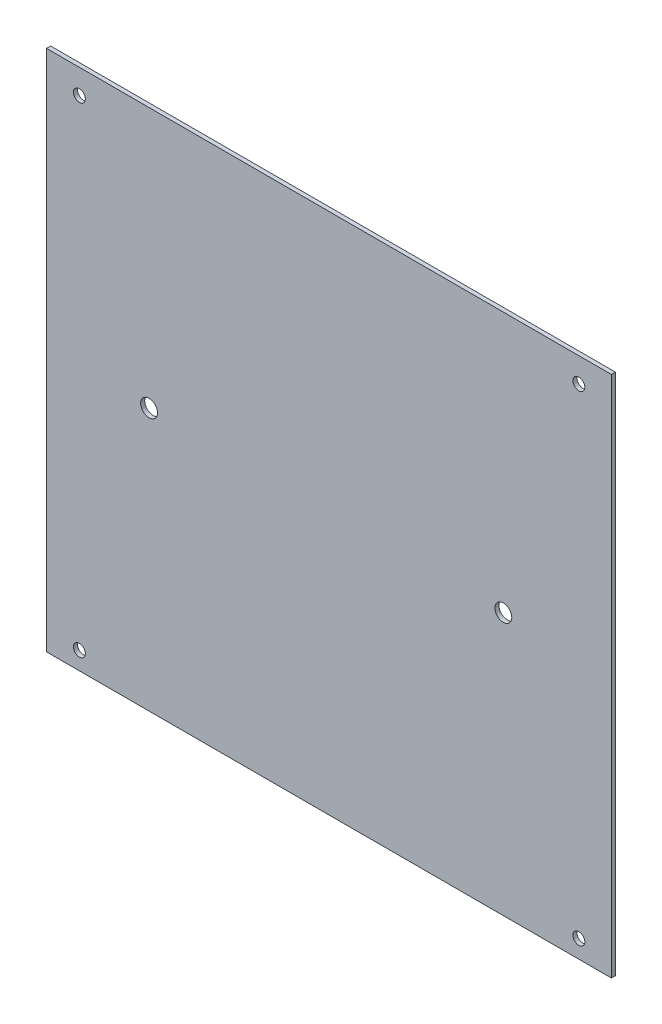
from build123d import *

# Parameters (mm, degrees)
SKETCH2_W                                      = 97.25
SKETCH2_H                                      = 90
BOSS_EXTRUDE1_DEPTH                            = 2
CSK_FOR_M2_5_FLAT_HEAD_MACHINE_SCREW3_AT_COUNT = 2
CSK_FOR_M2_5_FLAT_HEAD_MACHINE_SCREW3_AT_PITCH = 61
M2_5X0_45_TAPPED_HOLE1_D                       = 2.05
M2_5X0_45_TAPPED_HOLE1_DEPTH                   = 6.35
M2_5X0_45_TAPPED_HOLE1_TIP                     = 0.615882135
SKETCH29_W                                     = 97.25
SKETCH29_H                                     = 90
CUT_EXTRUDE1_DEPTH                             = 1.3


with BuildPart() as part:
    # Sketch2 → Boss-Extrude1 (new body)
    with BuildSketch(Plane.XY):
        with Locations((48.625, 45)):
            Rectangle(SKETCH2_W, SKETCH2_H)
    extrude(amount=BOSS_EXTRUDE1_DEPTH)

    # Sketch13 → CSK for M2.5 Flat Head Machine Screw3 (revolve, cut)
    with BuildSketch(Plane(origin=(78.65, 45.18, 2), x_dir=(0, -1, 0), z_dir=(1, 0, 0))):
        Polygon((0, 0), (0, 2), (1.45, 2), (1.45, 1.3), (2.75, 0), align=None)
    csk_for_m2_5_flat_head_machine_screw3 = revolve(axis=Axis((78.65, 45.18, 8.35), (0, 0, -1)), mode=Mode.SUBTRACT)

    # CSK for M2.5 Flat Head Machine Screw3 at: CSK for M2.5 Flat Head Machine Screw3 ×2
    with Locations(*[(-i * CSK_FOR_M2_5_FLAT_HEAD_MACHINE_SCREW3_AT_PITCH, 0, 0) for i in range(1, CSK_FOR_M2_5_FLAT_HEAD_MACHINE_SCREW3_AT_COUNT)]):
        add(csk_for_m2_5_flat_head_machine_screw3, mode=Mode.SUBTRACT)

    # M2.5x0.45 Tapped Hole1
    with Locations(Plane(origin=(0, 0, 0), x_dir=(-1, 0, 0), z_dir=(0, 0, -1))):
        with Locations((-91.65, 3.08), (-5.65, 3.08), (-5.65, 85.78), (-91.65, 85.78)):
            Hole(M2_5X0_45_TAPPED_HOLE1_D / 2, depth=M2_5X0_45_TAPPED_HOLE1_DEPTH)
            with Locations((0, 0, -(M2_5X0_45_TAPPED_HOLE1_DEPTH + M2_5X0_45_TAPPED_HOLE1_TIP / 2))):  # 118° drill point
                Cone(0, M2_5X0_45_TAPPED_HOLE1_D / 2, M2_5X0_45_TAPPED_HOLE1_TIP, mode=Mode.SUBTRACT)

    # Sketch29 → Cut-Extrude1 (cut)
    with BuildSketch(Plane.XY.offset(2)):
        with Locations((48.625, 45)):
            Rectangle(SKETCH29_W, SKETCH29_H)
    extrude(amount=-CUT_EXTRUDE1_DEPTH, mode=Mode.SUBTRACT)


solid = part.part
